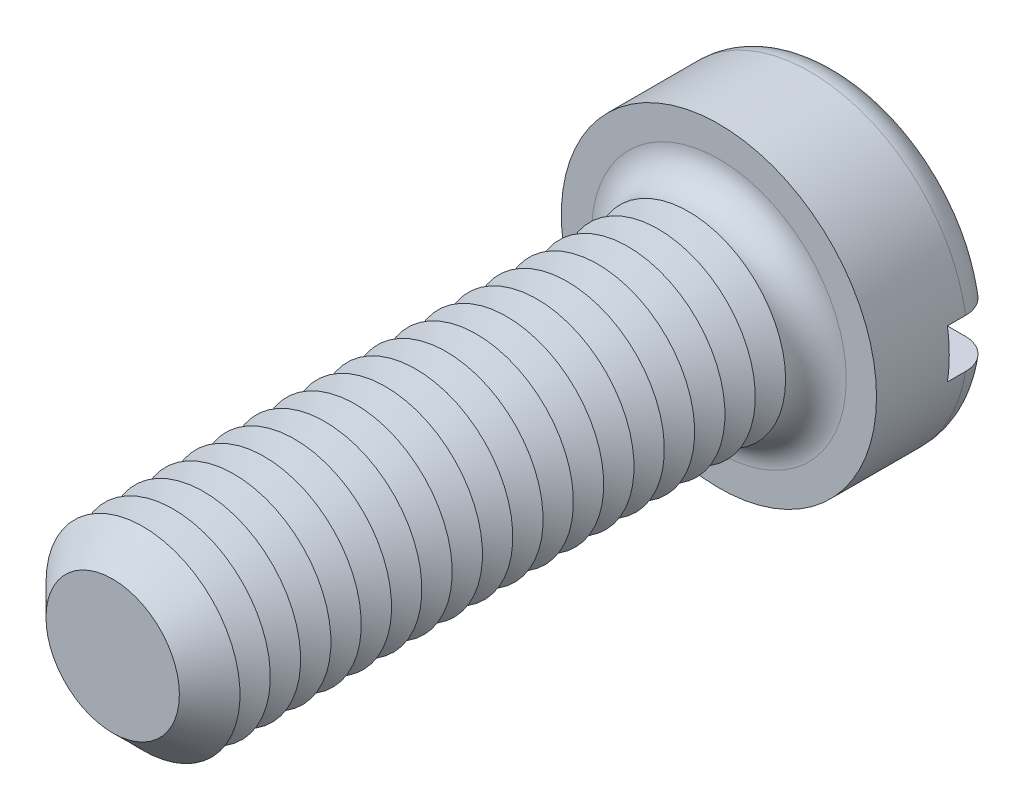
from build123d import *

# Parameters (mm, degrees)
SKETCH3_R           = 6.5
BOSS_EXTRUDE2_DEPTH = 5
SKETCH4_R           = 4
BOSS_EXTRUDE3_DEPTH = 25
FILLET1_R           = 1.25
CHAMFER1_SIZE       = 1.25
LPATTERN1_COUNT     = 18
LPATTERN1_PITCH     = 1.25
SKETCH8_W           = 13
SKETCH8_H           = 2
CUT_EXTRUDE1_DEPTH  = 2


with BuildPart() as part:
    # Sketch3 → Boss-Extrude2 (new body)
    with BuildSketch(Plane.XY):
        Circle(SKETCH3_R)
    extrude(amount=-BOSS_EXTRUDE2_DEPTH)

    # Sketch4 → Boss-Extrude3 (add)
    with BuildSketch(Plane.XY):
        Circle(SKETCH4_R)
    extrude(amount=BOSS_EXTRUDE3_DEPTH)

    # Fillet1
    fillet1_edges = [part.edges().sort_by_distance(p)[0] for p in [
        (-6.5, 0, -5),
        (-4, 0, 0),
    ]]
    fillet(fillet1_edges, radius=FILLET1_R)

    # Chamfer1
    chamfer1_edges = [part.edges().sort_by_distance(p)[0] for p in [
        (-4, 0, 25),
    ]]
    chamfer(chamfer1_edges, length=CHAMFER1_SIZE)

    # Sketch6 → Cut-Revolve1 (revolve, cut)
    with BuildSketch(Plane(origin=(0, 0, 0), x_dir=(0, 0, -1), z_dir=(1, 0, 0)), mode=Mode.PRIVATE) as cut_revolve1_sk:
        Polygon((-1.25, 4), (-1.875, 2.917468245), (-2.5, 4), align=None)
    cut_revolve1 = revolve(cut_revolve1_sk.sketch.rotate(Axis((0, 0, -1.694361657), (0, 0, 1)), 90), axis=Axis((0, 0, -1.694361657), (0, 0, 1)), mode=Mode.SUBTRACT)

    # LPattern1: Cut-Revolve1 ×18
    with Locations(*[(0, 0, i * LPATTERN1_PITCH) for i in range(1, LPATTERN1_COUNT)]):
        add(cut_revolve1, mode=Mode.SUBTRACT)

    # Sketch8 → Cut-Extrude1 (cut)
    with BuildSketch(Plane(origin=(0, 0, -5), x_dir=(-1, 0, 0), z_dir=(0, 0, -1))):
        Rectangle(SKETCH8_W, SKETCH8_H)
    extrude(amount=-CUT_EXTRUDE1_DEPTH, mode=Mode.SUBTRACT)


solid = part.part
